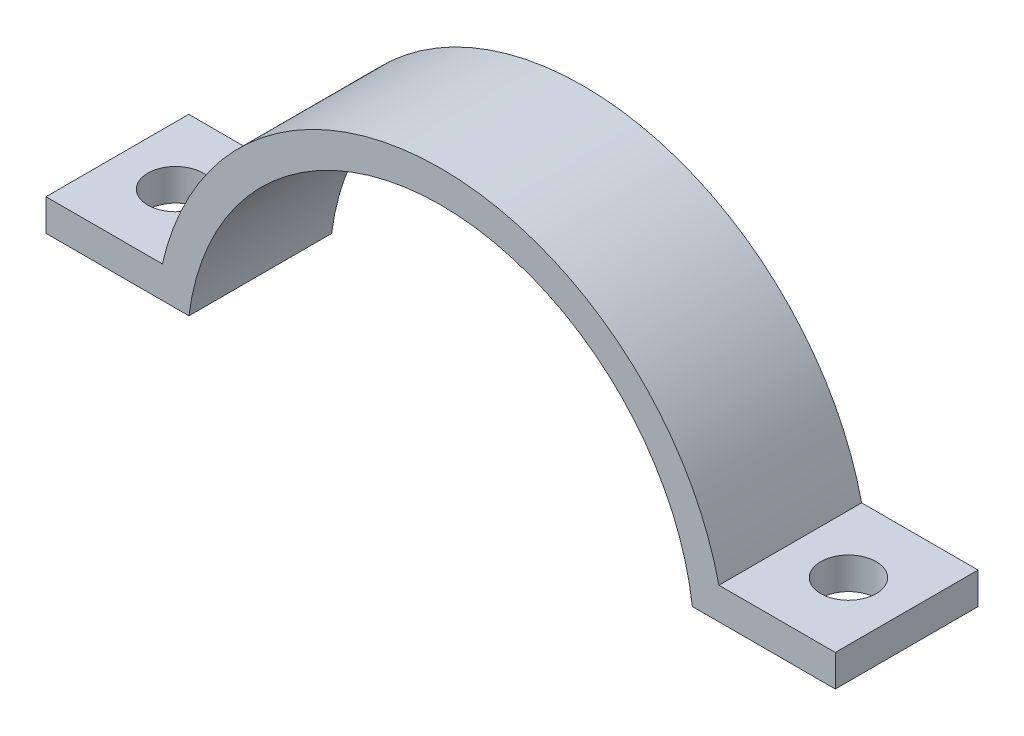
from build123d import *

# Parameters (mm, degrees)
BOSS_EXTRUDE1_DEPTH = 9
SKETCH2_R           = 1.75
CUT_EXTRUDE1_DEPTH  = 30.940601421


with BuildPart() as part:
    # Sketch1 → Boss-Extrude1 (new body)
    with BuildSketch(Plane.XY):
        with BuildLine():
            Line((-15.874507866, 4), (-15.874507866, 2))
            ThreePointArc((-15.874507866, 2), (0, 16), (15.874507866, 2))
            Line((15.874507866, 2), (15.874507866, 4))
            Line((15.874507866, 4), (17.549928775, 4))
            ThreePointArc((17.549928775, 4), (0, 18), (-17.549928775, 4))
            Line((-17.549928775, 4), (-15.874507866, 4))
        make_face()
        with BuildLine():
            ThreePointArc((-17.549928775, 4), (-17.747431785, 3.004773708), (-17.88854382, 2))
            Line((-17.88854382, 2), (-15.874507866, 2))
            Line((-15.874507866, 2), (-15.874507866, 4))
            Line((-15.874507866, 4), (-17.549928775, 4))
        make_face()
        with BuildLine():
            Line((-24.88854382, 2), (-17.88854382, 2))
            ThreePointArc((-17.88854382, 2), (-17.747431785, 3.004773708), (-17.549928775, 4))
            Line((-17.549928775, 4), (-24.88854382, 4))
            Line((-24.88854382, 4), (-24.88854382, 2))
        make_face()
        with BuildLine():
            Line((15.874507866, 4), (15.874507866, 2))
            Line((15.874507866, 2), (17.88854382, 2))
            ThreePointArc((17.88854382, 2), (17.747431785, 3.004773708), (17.549928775, 4))
            Line((17.549928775, 4), (15.874507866, 4))
        make_face()
        with BuildLine():
            Line((24.88854382, 4), (17.549928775, 4))
            ThreePointArc((17.549928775, 4), (17.747431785, 3.004773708), (17.88854382, 2))
            Line((17.88854382, 2), (24.88854382, 2))
            Line((24.88854382, 2), (24.88854382, 4))
        make_face()
    extrude(amount=BOSS_EXTRUDE1_DEPTH)

    # Sketch2 → Cut-Extrude1 (cut, through all)
    with BuildSketch(Plane(origin=(0, 4, 0), x_dir=(1, 0, 0), z_dir=(0, 1, 0))):
        with Locations(Location((-21.219236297, -4.5, 0), (0, 0, 180))):
            Circle(SKETCH2_R)
        with Locations(Location((21.219236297, -4.5, 0), (0, 0, 180))):
            Circle(SKETCH2_R)
    extrude(amount=-CUT_EXTRUDE1_DEPTH, mode=Mode.SUBTRACT)


solid = part.part
